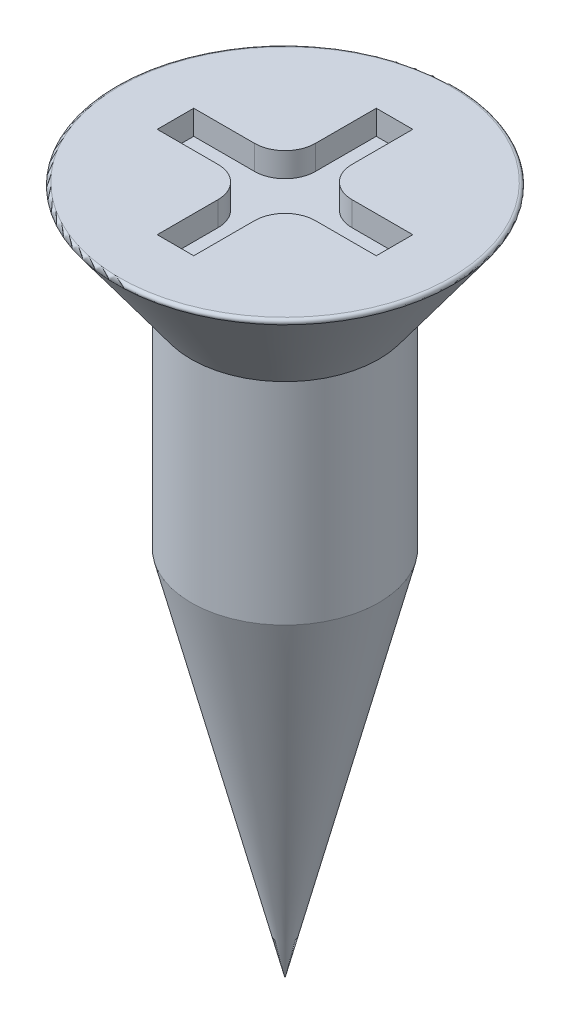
ISO-10303-21;
HEADER;
FILE_DESCRIPTION(('STEP AP214'),'2;1');
FILE_NAME('part.step','',(''),(''),'','','');
FILE_SCHEMA(('AUTOMOTIVE_DESIGN { 1 0 10303 214 1 1 1 1 }'));
ENDSEC;
DATA;
#1=APPLICATION_CONTEXT('core data for automotive mechanical design processes');
#2=APPLICATION_PROTOCOL_DEFINITION('international standard','automotive_design',2000,#1);
#3=PRODUCT_CONTEXT('',#1,'mechanical');
#4=PRODUCT('Part','Part','',(#3));
#5=PRODUCT_RELATED_PRODUCT_CATEGORY('part','',(#4));
#6=PRODUCT_DEFINITION_FORMATION('','',#4);
#7=PRODUCT_DEFINITION_CONTEXT('part definition',#1,'design');
#8=PRODUCT_DEFINITION('design','',#6,#7);
#9=PRODUCT_DEFINITION_SHAPE('','',#8);
#10=(LENGTH_UNIT() NAMED_UNIT(*) SI_UNIT(.MILLI.,.METRE.));
#11=(NAMED_UNIT(*) PLANE_ANGLE_UNIT() SI_UNIT($,.RADIAN.));
#12=(NAMED_UNIT(*) SI_UNIT($,.STERADIAN.) SOLID_ANGLE_UNIT());
#13=UNCERTAINTY_MEASURE_WITH_UNIT(LENGTH_MEASURE(1.E-05),#10,'distance_accuracy_value','');
#14=(GEOMETRIC_REPRESENTATION_CONTEXT(3) GLOBAL_UNCERTAINTY_ASSIGNED_CONTEXT((#13)) GLOBAL_UNIT_ASSIGNED_CONTEXT((#10,
#11,#12)) REPRESENTATION_CONTEXT('',''));
#15=CARTESIAN_POINT('',(0.,0.,0.));
#16=DIRECTION('',(0.,0.,1.));
#17=DIRECTION('',(1.,0.,0.));
#18=AXIS2_PLACEMENT_3D('',#15,#16,#17);
#19=CARTESIAN_POINT('',(0.,10.3838251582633,0.));
#20=DIRECTION('',(0.,1.,0.));
#21=DIRECTION('',(-1.,0.,0.));
#22=AXIS2_PLACEMENT_3D('',#19,#20,#21);
#23=CYLINDRICAL_SURFACE('',#22,1.54304418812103);
#24=CARTESIAN_POINT('',(0.,6.11360636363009,0.));
#25=DIRECTION('',(0.,1.,0.));
#26=DIRECTION('',(-1.,0.,0.));
#27=AXIS2_PLACEMENT_3D('',#24,#25,#26);
#28=CIRCLE('',#27,1.54304418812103);
#29=CARTESIAN_POINT('',(-1.54304418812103,6.11360636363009,0.));
#30=VERTEX_POINT('',#29);
#31=EDGE_CURVE('E223',#30,#30,#28,.T.);
#32=ORIENTED_EDGE('',*,*,#31,.T.);
#33=EDGE_LOOP('',(#32));
#34=FACE_BOUND('',#33,.T.);
#35=CARTESIAN_POINT('',(0.,9.57813960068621,0.));
#36=DIRECTION('',(0.,1.,0.));
#37=DIRECTION('',(-1.,0.,0.));
#38=AXIS2_PLACEMENT_3D('',#35,#36,#37);
#39=CIRCLE('',#38,1.54304418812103);
#40=CARTESIAN_POINT('',(-1.54304418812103,9.57813960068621,0.));
#41=VERTEX_POINT('',#40);
#42=EDGE_CURVE('E240',#41,#41,#39,.T.);
#43=ORIENTED_EDGE('',*,*,#42,.F.);
#44=EDGE_LOOP('',(#43));
#45=FACE_BOUND('',#44,.T.);
#46=ADVANCED_FACE('F32',(#34,#45),#23,.T.);
#47=CARTESIAN_POINT('',(0.,11.3295965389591,0.));
#48=DIRECTION('',(0.,1.,0.));
#49=DIRECTION('',(-1.,0.,0.));
#50=AXIS2_PLACEMENT_3D('',#47,#48,#49);
#51=CONICAL_SURFACE('',#50,2.82171279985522,0.630616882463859);
#52=CARTESIAN_POINT('',(0.,11.2501143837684,0.));
#53=DIRECTION('',(0.,-1.,0.));
#54=DIRECTION('',(1.,0.,0.));
#55=AXIS2_PLACEMENT_3D('',#52,#53,#54);
#56=CIRCLE('',#55,2.76368605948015);
#57=CARTESIAN_POINT('',(2.76368605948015,11.2501143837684,0.));
#58=VERTEX_POINT('',#57);
#59=EDGE_CURVE('E246',#58,#58,#56,.T.);
#60=ORIENTED_EDGE('',*,*,#59,.T.);
#61=EDGE_LOOP('',(#60));
#62=FACE_BOUND('',#61,.T.);
#63=ORIENTED_EDGE('',*,*,#42,.T.);
#64=EDGE_LOOP('',(#63));
#65=FACE_BOUND('',#64,.T.);
#66=ADVANCED_FACE('F314',(#62,#65),#51,.T.);
#67=CARTESIAN_POINT('',(-0.682551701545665,11.3295965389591,0.));
#68=DIRECTION('',(0.,1.,0.));
#69=DIRECTION('',(-1.,0.,0.));
#70=AXIS2_PLACEMENT_3D('',#67,#68,#69);
#71=PLANE('',#70);
#72=CARTESIAN_POINT('',(0.,11.3295965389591,0.));
#73=DIRECTION('',(0.,1.,0.));
#74=DIRECTION('',(-1.,0.,0.));
#75=AXIS2_PLACEMENT_3D('',#72,#73,#74);
#76=CIRCLE('',#75,2.72330286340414);
#77=CARTESIAN_POINT('',(-2.72330286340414,11.3295965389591,0.));
#78=VERTEX_POINT('',#77);
#79=EDGE_CURVE('E243',#78,#78,#76,.T.);
#80=ORIENTED_EDGE('',*,*,#79,.T.);
#81=EDGE_LOOP('',(#80));
#82=FACE_BOUND('',#81,.T.);
#83=DIRECTION('',(1.,0.,0.));
#84=VECTOR('',#83,1.);
#85=CARTESIAN_POINT('',(0.299999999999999,11.3295965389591,0.3));
#86=LINE('',#85,#84);
#87=CARTESIAN_POINT('',(0.8,11.3295965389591,0.3));
#88=VERTEX_POINT('',#87);
#89=CARTESIAN_POINT('',(1.8,11.3295965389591,0.3));
#90=VERTEX_POINT('',#89);
#91=EDGE_CURVE('E214',#88,#90,#86,.T.);
#92=ORIENTED_EDGE('',*,*,#91,.F.);
#93=CARTESIAN_POINT('',(0.8,11.3295965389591,0.8));
#94=DIRECTION('',(0.,1.,0.));
#95=DIRECTION('',(-1.,0.,0.));
#96=AXIS2_PLACEMENT_3D('',#93,#94,#95);
#97=CIRCLE('',#96,0.5);
#98=CARTESIAN_POINT('',(0.299999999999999,11.3295965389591,0.8));
#99=VERTEX_POINT('',#98);
#100=EDGE_CURVE('E258',#88,#99,#97,.T.);
#101=ORIENTED_EDGE('',*,*,#100,.T.);
#102=DIRECTION('',(0.,0.,-1.));
#103=VECTOR('',#102,1.);
#104=CARTESIAN_POINT('',(0.3,11.3295965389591,1.8));
#105=LINE('',#104,#103);
#106=CARTESIAN_POINT('',(0.3,11.3295965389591,1.8));
#107=VERTEX_POINT('',#106);
#108=EDGE_CURVE('E211',#107,#99,#105,.T.);
#109=ORIENTED_EDGE('',*,*,#108,.F.);
#110=DIRECTION('',(1.,0.,0.));
#111=VECTOR('',#110,1.);
#112=CARTESIAN_POINT('',(-0.3,11.3295965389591,1.8));
#113=LINE('',#112,#111);
#114=CARTESIAN_POINT('',(-0.3,11.3295965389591,1.8));
#115=VERTEX_POINT('',#114);
#116=EDGE_CURVE('E208',#115,#107,#113,.T.);
#117=ORIENTED_EDGE('',*,*,#116,.F.);
#118=DIRECTION('',(0.,0.,1.));
#119=VECTOR('',#118,1.);
#120=CARTESIAN_POINT('',(-0.3,11.3295965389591,1.8));
#121=LINE('',#120,#119);
#122=CARTESIAN_POINT('',(-0.3,11.3295965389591,0.8));
#123=VERTEX_POINT('',#122);
#124=EDGE_CURVE('E206',#123,#115,#121,.T.);
#125=ORIENTED_EDGE('',*,*,#124,.F.);
#126=CARTESIAN_POINT('',(-0.8,11.3295965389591,0.8));
#127=DIRECTION('',(0.,1.,0.));
#128=DIRECTION('',(-1.,0.,0.));
#129=AXIS2_PLACEMENT_3D('',#126,#127,#128);
#130=CIRCLE('',#129,0.5);
#131=CARTESIAN_POINT('',(-0.8,11.3295965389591,0.3));
#132=VERTEX_POINT('',#131);
#133=EDGE_CURVE('E254',#123,#132,#130,.T.);
#134=ORIENTED_EDGE('',*,*,#133,.T.);
#135=DIRECTION('',(1.,0.,0.));
#136=VECTOR('',#135,1.);
#137=CARTESIAN_POINT('',(-0.3,11.3295965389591,0.3));
#138=LINE('',#137,#136);
#139=CARTESIAN_POINT('',(-1.8,11.3295965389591,0.3));
#140=VERTEX_POINT('',#139);
#141=EDGE_CURVE('E203',#140,#132,#138,.T.);
#142=ORIENTED_EDGE('',*,*,#141,.F.);
#143=DIRECTION('',(0.,0.,1.));
#144=VECTOR('',#143,1.);
#145=CARTESIAN_POINT('',(-1.8,11.3295965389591,-0.3));
#146=LINE('',#145,#144);
#147=CARTESIAN_POINT('',(-1.8,11.3295965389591,-0.3));
#148=VERTEX_POINT('',#147);
#149=EDGE_CURVE('E200',#148,#140,#146,.T.);
#150=ORIENTED_EDGE('',*,*,#149,.F.);
#151=DIRECTION('',(-1.,0.,0.));
#152=VECTOR('',#151,1.);
#153=CARTESIAN_POINT('',(-0.3,11.3295965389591,-0.3));
#154=LINE('',#153,#152);
#155=CARTESIAN_POINT('',(-0.8,11.3295965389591,-0.3));
#156=VERTEX_POINT('',#155);
#157=EDGE_CURVE('E198',#156,#148,#154,.T.);
#158=ORIENTED_EDGE('',*,*,#157,.F.);
#159=CARTESIAN_POINT('',(-0.8,11.3295965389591,-0.8));
#160=DIRECTION('',(0.,1.,0.));
#161=DIRECTION('',(-1.,0.,0.));
#162=AXIS2_PLACEMENT_3D('',#159,#160,#161);
#163=CIRCLE('',#162,0.5);
#164=CARTESIAN_POINT('',(-0.3,11.3295965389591,-0.8));
#165=VERTEX_POINT('',#164);
#166=EDGE_CURVE('E252',#156,#165,#163,.T.);
#167=ORIENTED_EDGE('',*,*,#166,.T.);
#168=DIRECTION('',(0.,0.,1.));
#169=VECTOR('',#168,1.);
#170=CARTESIAN_POINT('',(-0.3,11.3295965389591,-1.8));
#171=LINE('',#170,#169);
#172=CARTESIAN_POINT('',(-0.3,11.3295965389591,-1.8));
#173=VERTEX_POINT('',#172);
#174=EDGE_CURVE('E196',#173,#165,#171,.T.);
#175=ORIENTED_EDGE('',*,*,#174,.F.);
#176=DIRECTION('',(-1.,0.,0.));
#177=VECTOR('',#176,1.);
#178=CARTESIAN_POINT('',(-0.3,11.3295965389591,-1.8));
#179=LINE('',#178,#177);
#180=CARTESIAN_POINT('',(0.3,11.3295965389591,-1.8));
#181=VERTEX_POINT('',#180);
#182=EDGE_CURVE('E154',#181,#173,#179,.T.);
#183=ORIENTED_EDGE('',*,*,#182,.F.);
#184=DIRECTION('',(0.,0.,-1.));
#185=VECTOR('',#184,1.);
#186=CARTESIAN_POINT('',(0.3,11.3295965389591,-1.8));
#187=LINE('',#186,#185);
#188=CARTESIAN_POINT('',(0.299999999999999,11.3295965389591,-0.8));
#189=VERTEX_POINT('',#188);
#190=EDGE_CURVE('E166',#189,#181,#187,.T.);
#191=ORIENTED_EDGE('',*,*,#190,.F.);
#192=CARTESIAN_POINT('',(0.8,11.3295965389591,-0.8));
#193=DIRECTION('',(0.,1.,0.));
#194=DIRECTION('',(-1.,0.,0.));
#195=AXIS2_PLACEMENT_3D('',#192,#193,#194);
#196=CIRCLE('',#195,0.5);
#197=CARTESIAN_POINT('',(0.8,11.3295965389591,-0.3));
#198=VERTEX_POINT('',#197);
#199=EDGE_CURVE('E256',#189,#198,#196,.T.);
#200=ORIENTED_EDGE('',*,*,#199,.T.);
#201=DIRECTION('',(-1.,0.,0.));
#202=VECTOR('',#201,1.);
#203=CARTESIAN_POINT('',(0.299999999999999,11.3295965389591,-0.3));
#204=LINE('',#203,#202);
#205=CARTESIAN_POINT('',(1.8,11.3295965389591,-0.3));
#206=VERTEX_POINT('',#205);
#207=EDGE_CURVE('E168',#206,#198,#204,.T.);
#208=ORIENTED_EDGE('',*,*,#207,.F.);
#209=DIRECTION('',(0.,0.,-1.));
#210=VECTOR('',#209,1.);
#211=CARTESIAN_POINT('',(1.8,11.3295965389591,0.3));
#212=LINE('',#211,#210);
#213=EDGE_CURVE('E216',#90,#206,#212,.T.);
#214=ORIENTED_EDGE('',*,*,#213,.F.);
#215=EDGE_LOOP('',(#92,#101,#109,#117,#125,#134,#142,#150,#158,#167,#175,#183,#191,#200,#208,#214));
#216=FACE_BOUND('',#215,.T.);
#217=ADVANCED_FACE('F294',(#82,#216),#71,.T.);
#218=CARTESIAN_POINT('',(0.,6.11360636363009,0.));
#219=DIRECTION('',(0.,1.,0.));
#220=DIRECTION('',(-1.,0.,0.));
#221=AXIS2_PLACEMENT_3D('',#218,#219,#220);
#222=CONICAL_SURFACE('',#221,1.54304418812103,0.247231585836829);
#223=CARTESIAN_POINT('',(0.,0.,0.));
#224=VERTEX_POINT('',#223);
#225=VERTEX_LOOP('',#224);
#226=FACE_BOUND('',#225,.T.);
#227=ORIENTED_EDGE('',*,*,#31,.F.);
#228=EDGE_LOOP('',(#227));
#229=FACE_BOUND('',#228,.T.);
#230=ADVANCED_FACE('F384',(#226,#229),#222,.T.);
#231=CARTESIAN_POINT('',(-0.3,10.9295965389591,-1.8));
#232=DIRECTION('',(0.,0.,-1.));
#233=DIRECTION('',(-1.,0.,0.));
#234=AXIS2_PLACEMENT_3D('',#231,#232,#233);
#235=PLANE('',#234);
#236=ORIENTED_EDGE('',*,*,#182,.T.);
#237=DIRECTION('',(0.,1.,0.));
#238=VECTOR('',#237,1.);
#239=CARTESIAN_POINT('',(-0.3,10.9295965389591,-1.8));
#240=LINE('',#239,#238);
#241=CARTESIAN_POINT('',(-0.3,10.9295965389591,-1.8));
#242=VERTEX_POINT('',#241);
#243=EDGE_CURVE('E148',#242,#173,#240,.T.);
#244=ORIENTED_EDGE('',*,*,#243,.F.);
#245=DIRECTION('',(-1.,0.,0.));
#246=VECTOR('',#245,1.);
#247=CARTESIAN_POINT('',(-0.3,10.9295965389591,-1.8));
#248=LINE('',#247,#246);
#249=CARTESIAN_POINT('',(0.3,10.9295965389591,-1.8));
#250=VERTEX_POINT('',#249);
#251=EDGE_CURVE('E152',#250,#242,#248,.T.);
#252=ORIENTED_EDGE('',*,*,#251,.F.);
#253=DIRECTION('',(0.,1.,0.));
#254=VECTOR('',#253,1.);
#255=CARTESIAN_POINT('',(0.3,10.9295965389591,-1.8));
#256=LINE('',#255,#254);
#257=EDGE_CURVE('E221',#250,#181,#256,.T.);
#258=ORIENTED_EDGE('',*,*,#257,.T.);
#259=EDGE_LOOP('',(#236,#244,#252,#258));
#260=FACE_BOUND('',#259,.T.);
#261=ADVANCED_FACE('F149',(#260),#235,.F.);
#262=CARTESIAN_POINT('',(0.3,10.9295965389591,-1.8));
#263=DIRECTION('',(1.,0.,0.));
#264=DIRECTION('',(0.,0.,-1.));
#265=AXIS2_PLACEMENT_3D('',#262,#263,#264);
#266=PLANE('',#265);
#267=DIRECTION('',(0.,0.,-1.));
#268=VECTOR('',#267,1.);
#269=CARTESIAN_POINT('',(0.3,10.9295965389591,-1.8));
#270=LINE('',#269,#268);
#271=CARTESIAN_POINT('',(0.299999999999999,10.9295965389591,-0.8));
#272=VERTEX_POINT('',#271);
#273=EDGE_CURVE('E157',#272,#250,#270,.T.);
#274=ORIENTED_EDGE('',*,*,#273,.F.);
#275=DIRECTION('',(0.,1.,0.));
#276=VECTOR('',#275,1.);
#277=CARTESIAN_POINT('',(0.299999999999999,10.9295965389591,-0.8));
#278=LINE('',#277,#276);
#279=EDGE_CURVE('E262',#272,#189,#278,.T.);
#280=ORIENTED_EDGE('',*,*,#279,.T.);
#281=ORIENTED_EDGE('',*,*,#190,.T.);
#282=ORIENTED_EDGE('',*,*,#257,.F.);
#283=EDGE_LOOP('',(#274,#280,#281,#282));
#284=FACE_BOUND('',#283,.T.);
#285=ADVANCED_FACE('F342',(#284),#266,.F.);
#286=CARTESIAN_POINT('',(0.299999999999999,10.9295965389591,-0.3));
#287=DIRECTION('',(0.,0.,-1.));
#288=DIRECTION('',(-1.,0.,0.));
#289=AXIS2_PLACEMENT_3D('',#286,#287,#288);
#290=PLANE('',#289);
#291=ORIENTED_EDGE('',*,*,#207,.T.);
#292=DIRECTION('',(0.,1.,0.));
#293=VECTOR('',#292,1.);
#294=CARTESIAN_POINT('',(0.8,10.9295965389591,-0.3));
#295=LINE('',#294,#293);
#296=CARTESIAN_POINT('',(0.8,10.9295965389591,-0.3));
#297=VERTEX_POINT('',#296);
#298=EDGE_CURVE('E265',#198,#297,#295,.F.);
#299=ORIENTED_EDGE('',*,*,#298,.T.);
#300=DIRECTION('',(-1.,0.,0.));
#301=VECTOR('',#300,1.);
#302=CARTESIAN_POINT('',(0.299999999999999,10.9295965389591,-0.3));
#303=LINE('',#302,#301);
#304=CARTESIAN_POINT('',(1.8,10.9295965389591,-0.3));
#305=VERTEX_POINT('',#304);
#306=EDGE_CURVE('E191',#305,#297,#303,.T.);
#307=ORIENTED_EDGE('',*,*,#306,.F.);
#308=DIRECTION('',(0.,1.,0.));
#309=VECTOR('',#308,1.);
#310=CARTESIAN_POINT('',(1.8,10.9295965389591,-0.3));
#311=LINE('',#310,#309);
#312=EDGE_CURVE('E224',#305,#206,#311,.T.);
#313=ORIENTED_EDGE('',*,*,#312,.T.);
#314=EDGE_LOOP('',(#291,#299,#307,#313));
#315=FACE_BOUND('',#314,.T.);
#316=ADVANCED_FACE('F347',(#315),#290,.F.);
#317=CARTESIAN_POINT('',(1.8,10.9295965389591,0.3));
#318=DIRECTION('',(1.,0.,0.));
#319=DIRECTION('',(0.,1.,0.));
#320=AXIS2_PLACEMENT_3D('',#317,#318,#319);
#321=PLANE('',#320);
#322=ORIENTED_EDGE('',*,*,#213,.T.);
#323=ORIENTED_EDGE('',*,*,#312,.F.);
#324=DIRECTION('',(0.,0.,-1.));
#325=VECTOR('',#324,1.);
#326=CARTESIAN_POINT('',(1.8,10.9295965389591,0.3));
#327=LINE('',#326,#325);
#328=CARTESIAN_POINT('',(1.8,10.9295965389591,0.3));
#329=VERTEX_POINT('',#328);
#330=EDGE_CURVE('E188',#329,#305,#327,.T.);
#331=ORIENTED_EDGE('',*,*,#330,.F.);
#332=DIRECTION('',(0.,1.,0.));
#333=VECTOR('',#332,1.);
#334=CARTESIAN_POINT('',(1.8,10.9295965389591,0.3));
#335=LINE('',#334,#333);
#336=EDGE_CURVE('E226',#329,#90,#335,.T.);
#337=ORIENTED_EDGE('',*,*,#336,.T.);
#338=EDGE_LOOP('',(#322,#323,#331,#337));
#339=FACE_BOUND('',#338,.T.);
#340=ADVANCED_FACE('F350',(#339),#321,.F.);
#341=CARTESIAN_POINT('',(0.299999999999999,10.9295965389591,0.3));
#342=DIRECTION('',(0.,0.,1.));
#343=DIRECTION('',(1.,0.,0.));
#344=AXIS2_PLACEMENT_3D('',#341,#342,#343);
#345=PLANE('',#344);
#346=DIRECTION('',(1.,0.,0.));
#347=VECTOR('',#346,1.);
#348=CARTESIAN_POINT('',(0.299999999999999,10.9295965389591,0.3));
#349=LINE('',#348,#347);
#350=CARTESIAN_POINT('',(0.8,10.9295965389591,0.3));
#351=VERTEX_POINT('',#350);
#352=EDGE_CURVE('E186',#351,#329,#349,.T.);
#353=ORIENTED_EDGE('',*,*,#352,.F.);
#354=DIRECTION('',(0.,1.,0.));
#355=VECTOR('',#354,1.);
#356=CARTESIAN_POINT('',(0.8,10.9295965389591,0.3));
#357=LINE('',#356,#355);
#358=EDGE_CURVE('E249',#351,#88,#357,.T.);
#359=ORIENTED_EDGE('',*,*,#358,.T.);
#360=ORIENTED_EDGE('',*,*,#91,.T.);
#361=ORIENTED_EDGE('',*,*,#336,.F.);
#362=EDGE_LOOP('',(#353,#359,#360,#361));
#363=FACE_BOUND('',#362,.T.);
#364=ADVANCED_FACE('F355',(#363),#345,.F.);
#365=CARTESIAN_POINT('',(0.3,10.9295965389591,1.8));
#366=DIRECTION('',(1.,0.,0.));
#367=DIRECTION('',(0.,0.,-1.));
#368=AXIS2_PLACEMENT_3D('',#365,#366,#367);
#369=PLANE('',#368);
#370=ORIENTED_EDGE('',*,*,#108,.T.);
#371=DIRECTION('',(0.,1.,0.));
#372=VECTOR('',#371,1.);
#373=CARTESIAN_POINT('',(0.299999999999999,10.9295965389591,0.8));
#374=LINE('',#373,#372);
#375=CARTESIAN_POINT('',(0.299999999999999,10.9295965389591,0.8));
#376=VERTEX_POINT('',#375);
#377=EDGE_CURVE('E260',#99,#376,#374,.F.);
#378=ORIENTED_EDGE('',*,*,#377,.T.);
#379=DIRECTION('',(0.,0.,-1.));
#380=VECTOR('',#379,1.);
#381=CARTESIAN_POINT('',(0.3,10.9295965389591,1.8));
#382=LINE('',#381,#380);
#383=CARTESIAN_POINT('',(0.3,10.9295965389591,1.8));
#384=VERTEX_POINT('',#383);
#385=EDGE_CURVE('E183',#384,#376,#382,.T.);
#386=ORIENTED_EDGE('',*,*,#385,.F.);
#387=DIRECTION('',(0.,1.,0.));
#388=VECTOR('',#387,1.);
#389=CARTESIAN_POINT('',(0.3,10.9295965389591,1.8));
#390=LINE('',#389,#388);
#391=EDGE_CURVE('E229',#384,#107,#390,.T.);
#392=ORIENTED_EDGE('',*,*,#391,.T.);
#393=EDGE_LOOP('',(#370,#378,#386,#392));
#394=FACE_BOUND('',#393,.T.);
#395=ADVANCED_FACE('F361',(#394),#369,.F.);
#396=CARTESIAN_POINT('',(-0.3,10.9295965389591,1.8));
#397=DIRECTION('',(0.,0.,1.));
#398=DIRECTION('',(1.,0.,0.));
#399=AXIS2_PLACEMENT_3D('',#396,#397,#398);
#400=PLANE('',#399);
#401=ORIENTED_EDGE('',*,*,#116,.T.);
#402=ORIENTED_EDGE('',*,*,#391,.F.);
#403=DIRECTION('',(1.,0.,0.));
#404=VECTOR('',#403,1.);
#405=CARTESIAN_POINT('',(-0.3,10.9295965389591,1.8));
#406=LINE('',#405,#404);
#407=CARTESIAN_POINT('',(-0.3,10.9295965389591,1.8));
#408=VERTEX_POINT('',#407);
#409=EDGE_CURVE('E180',#408,#384,#406,.T.);
#410=ORIENTED_EDGE('',*,*,#409,.F.);
#411=DIRECTION('',(0.,1.,0.));
#412=VECTOR('',#411,1.);
#413=CARTESIAN_POINT('',(-0.3,10.9295965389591,1.8));
#414=LINE('',#413,#412);
#415=EDGE_CURVE('E231',#408,#115,#414,.T.);
#416=ORIENTED_EDGE('',*,*,#415,.T.);
#417=EDGE_LOOP('',(#401,#402,#410,#416));
#418=FACE_BOUND('',#417,.T.);
#419=ADVANCED_FACE('F363',(#418),#400,.F.);
#420=CARTESIAN_POINT('',(-0.3,10.9295965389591,1.8));
#421=DIRECTION('',(-1.,0.,0.));
#422=DIRECTION('',(0.,0.,1.));
#423=AXIS2_PLACEMENT_3D('',#420,#421,#422);
#424=PLANE('',#423);
#425=DIRECTION('',(0.,0.,1.));
#426=VECTOR('',#425,1.);
#427=CARTESIAN_POINT('',(-0.3,10.9295965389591,1.8));
#428=LINE('',#427,#426);
#429=CARTESIAN_POINT('',(-0.3,10.9295965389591,0.8));
#430=VERTEX_POINT('',#429);
#431=EDGE_CURVE('E178',#430,#408,#428,.T.);
#432=ORIENTED_EDGE('',*,*,#431,.F.);
#433=DIRECTION('',(0.,1.,0.));
#434=VECTOR('',#433,1.);
#435=CARTESIAN_POINT('',(-0.3,10.9295965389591,0.8));
#436=LINE('',#435,#434);
#437=EDGE_CURVE('E267',#430,#123,#436,.T.);
#438=ORIENTED_EDGE('',*,*,#437,.T.);
#439=ORIENTED_EDGE('',*,*,#124,.T.);
#440=ORIENTED_EDGE('',*,*,#415,.F.);
#441=EDGE_LOOP('',(#432,#438,#439,#440));
#442=FACE_BOUND('',#441,.T.);
#443=ADVANCED_FACE('F287',(#442),#424,.F.);
#444=CARTESIAN_POINT('',(-0.3,10.9295965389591,0.3));
#445=DIRECTION('',(0.,0.,1.));
#446=DIRECTION('',(1.,0.,0.));
#447=AXIS2_PLACEMENT_3D('',#444,#445,#446);
#448=PLANE('',#447);
#449=ORIENTED_EDGE('',*,*,#141,.T.);
#450=DIRECTION('',(0.,1.,0.));
#451=VECTOR('',#450,1.);
#452=CARTESIAN_POINT('',(-0.8,10.9295965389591,0.3));
#453=LINE('',#452,#451);
#454=CARTESIAN_POINT('',(-0.8,10.9295965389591,0.3));
#455=VERTEX_POINT('',#454);
#456=EDGE_CURVE('E270',#132,#455,#453,.F.);
#457=ORIENTED_EDGE('',*,*,#456,.T.);
#458=DIRECTION('',(1.,0.,0.));
#459=VECTOR('',#458,1.);
#460=CARTESIAN_POINT('',(-0.3,10.9295965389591,0.3));
#461=LINE('',#460,#459);
#462=CARTESIAN_POINT('',(-1.8,10.9295965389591,0.3));
#463=VERTEX_POINT('',#462);
#464=EDGE_CURVE('E175',#463,#455,#461,.T.);
#465=ORIENTED_EDGE('',*,*,#464,.F.);
#466=DIRECTION('',(0.,1.,0.));
#467=VECTOR('',#466,1.);
#468=CARTESIAN_POINT('',(-1.8,10.9295965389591,0.3));
#469=LINE('',#468,#467);
#470=EDGE_CURVE('E234',#463,#140,#469,.T.);
#471=ORIENTED_EDGE('',*,*,#470,.T.);
#472=EDGE_LOOP('',(#449,#457,#465,#471));
#473=FACE_BOUND('',#472,.T.);
#474=ADVANCED_FACE('F298',(#473),#448,.F.);
#475=CARTESIAN_POINT('',(-1.8,10.9295965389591,-0.3));
#476=DIRECTION('',(-1.,0.,0.));
#477=DIRECTION('',(0.,-1.,0.));
#478=AXIS2_PLACEMENT_3D('',#475,#476,#477);
#479=PLANE('',#478);
#480=ORIENTED_EDGE('',*,*,#149,.T.);
#481=ORIENTED_EDGE('',*,*,#470,.F.);
#482=DIRECTION('',(0.,0.,1.));
#483=VECTOR('',#482,1.);
#484=CARTESIAN_POINT('',(-1.8,10.9295965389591,-0.3));
#485=LINE('',#484,#483);
#486=CARTESIAN_POINT('',(-1.8,10.9295965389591,-0.3));
#487=VERTEX_POINT('',#486);
#488=EDGE_CURVE('E172',#487,#463,#485,.T.);
#489=ORIENTED_EDGE('',*,*,#488,.F.);
#490=DIRECTION('',(0.,1.,0.));
#491=VECTOR('',#490,1.);
#492=CARTESIAN_POINT('',(-1.8,10.9295965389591,-0.3));
#493=LINE('',#492,#491);
#494=EDGE_CURVE('E156',#487,#148,#493,.T.);
#495=ORIENTED_EDGE('',*,*,#494,.T.);
#496=EDGE_LOOP('',(#480,#481,#489,#495));
#497=FACE_BOUND('',#496,.T.);
#498=ADVANCED_FACE('F301',(#497),#479,.F.);
#499=CARTESIAN_POINT('',(-0.3,10.9295965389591,-0.3));
#500=DIRECTION('',(0.,0.,-1.));
#501=DIRECTION('',(-1.,0.,0.));
#502=AXIS2_PLACEMENT_3D('',#499,#500,#501);
#503=PLANE('',#502);
#504=DIRECTION('',(-1.,0.,0.));
#505=VECTOR('',#504,1.);
#506=CARTESIAN_POINT('',(-0.3,10.9295965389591,-0.3));
#507=LINE('',#506,#505);
#508=CARTESIAN_POINT('',(-0.8,10.9295965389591,-0.3));
#509=VERTEX_POINT('',#508);
#510=EDGE_CURVE('E161',#509,#487,#507,.T.);
#511=ORIENTED_EDGE('',*,*,#510,.F.);
#512=DIRECTION('',(0.,1.,0.));
#513=VECTOR('',#512,1.);
#514=CARTESIAN_POINT('',(-0.8,10.9295965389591,-0.3));
#515=LINE('',#514,#513);
#516=EDGE_CURVE('E272',#509,#156,#515,.T.);
#517=ORIENTED_EDGE('',*,*,#516,.T.);
#518=ORIENTED_EDGE('',*,*,#157,.T.);
#519=ORIENTED_EDGE('',*,*,#494,.F.);
#520=EDGE_LOOP('',(#511,#517,#518,#519));
#521=FACE_BOUND('',#520,.T.);
#522=ADVANCED_FACE('F305',(#521),#503,.F.);
#523=CARTESIAN_POINT('',(-0.3,10.9295965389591,-1.8));
#524=DIRECTION('',(-1.,0.,0.));
#525=DIRECTION('',(0.,0.,1.));
#526=AXIS2_PLACEMENT_3D('',#523,#524,#525);
#527=PLANE('',#526);
#528=ORIENTED_EDGE('',*,*,#174,.T.);
#529=DIRECTION('',(0.,1.,0.));
#530=VECTOR('',#529,1.);
#531=CARTESIAN_POINT('',(-0.3,10.9295965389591,-0.8));
#532=LINE('',#531,#530);
#533=CARTESIAN_POINT('',(-0.3,10.9295965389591,-0.8));
#534=VERTEX_POINT('',#533);
#535=EDGE_CURVE('E47',#165,#534,#532,.F.);
#536=ORIENTED_EDGE('',*,*,#535,.T.);
#537=DIRECTION('',(0.,0.,1.));
#538=VECTOR('',#537,1.);
#539=CARTESIAN_POINT('',(-0.3,10.9295965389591,-1.8));
#540=LINE('',#539,#538);
#541=EDGE_CURVE('E159',#242,#534,#540,.T.);
#542=ORIENTED_EDGE('',*,*,#541,.F.);
#543=ORIENTED_EDGE('',*,*,#243,.T.);
#544=EDGE_LOOP('',(#528,#536,#542,#543));
#545=FACE_BOUND('',#544,.T.);
#546=ADVANCED_FACE('F160',(#545),#527,.F.);
#547=CARTESIAN_POINT('',(0.,10.9295965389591,0.));
#548=DIRECTION('',(0.,-1.,0.));
#549=DIRECTION('',(0.,0.,-1.));
#550=AXIS2_PLACEMENT_3D('',#547,#548,#549);
#551=PLANE('',#550);
#552=ORIENTED_EDGE('',*,*,#251,.T.);
#553=ORIENTED_EDGE('',*,*,#541,.T.);
#554=CARTESIAN_POINT('',(-0.8,10.9295965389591,-0.8));
#555=DIRECTION('',(0.,-1.,0.));
#556=DIRECTION('',(0.,0.,-1.));
#557=AXIS2_PLACEMENT_3D('',#554,#555,#556);
#558=CIRCLE('',#557,0.5);
#559=EDGE_CURVE('E11',#534,#509,#558,.T.);
#560=ORIENTED_EDGE('',*,*,#559,.T.);
#561=ORIENTED_EDGE('',*,*,#510,.T.);
#562=ORIENTED_EDGE('',*,*,#488,.T.);
#563=ORIENTED_EDGE('',*,*,#464,.T.);
#564=CARTESIAN_POINT('',(-0.8,10.9295965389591,0.8));
#565=DIRECTION('',(0.,-1.,0.));
#566=DIRECTION('',(0.,0.,-1.));
#567=AXIS2_PLACEMENT_3D('',#564,#565,#566);
#568=CIRCLE('',#567,0.5);
#569=EDGE_CURVE('E40',#455,#430,#568,.T.);
#570=ORIENTED_EDGE('',*,*,#569,.T.);
#571=ORIENTED_EDGE('',*,*,#431,.T.);
#572=ORIENTED_EDGE('',*,*,#409,.T.);
#573=ORIENTED_EDGE('',*,*,#385,.T.);
#574=CARTESIAN_POINT('',(0.8,10.9295965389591,0.8));
#575=DIRECTION('',(0.,-1.,0.));
#576=DIRECTION('',(0.,0.,-1.));
#577=AXIS2_PLACEMENT_3D('',#574,#575,#576);
#578=CIRCLE('',#577,0.5);
#579=EDGE_CURVE('E276',#376,#351,#578,.T.);
#580=ORIENTED_EDGE('',*,*,#579,.T.);
#581=ORIENTED_EDGE('',*,*,#352,.T.);
#582=ORIENTED_EDGE('',*,*,#330,.T.);
#583=ORIENTED_EDGE('',*,*,#306,.T.);
#584=CARTESIAN_POINT('',(0.8,10.9295965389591,-0.8));
#585=DIRECTION('',(0.,-1.,0.));
#586=DIRECTION('',(0.,0.,-1.));
#587=AXIS2_PLACEMENT_3D('',#584,#585,#586);
#588=CIRCLE('',#587,0.5);
#589=EDGE_CURVE('E278',#297,#272,#588,.T.);
#590=ORIENTED_EDGE('',*,*,#589,.T.);
#591=ORIENTED_EDGE('',*,*,#273,.T.);
#592=EDGE_LOOP('',(#552,#553,#560,#561,#562,#563,#570,#571,#572,#573,#580,#581,#582,#583,#590,#591));
#593=FACE_BOUND('',#592,.T.);
#594=ADVANCED_FACE('F163',(#593),#551,.F.);
#595=CARTESIAN_POINT('',(0.,11.2795965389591,0.));
#596=DIRECTION('',(0.,1.,0.));
#597=DIRECTION('',(-1.,0.,0.));
#598=AXIS2_PLACEMENT_3D('',#595,#596,#597);
#599=TOROIDAL_SURFACE('',#598,2.72330286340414,0.05);
#600=ORIENTED_EDGE('',*,*,#59,.F.);
#601=EDGE_LOOP('',(#600));
#602=FACE_BOUND('',#601,.T.);
#603=ORIENTED_EDGE('',*,*,#79,.F.);
#604=EDGE_LOOP('',(#603));
#605=FACE_BOUND('',#604,.T.);
#606=ADVANCED_FACE('F325',(#602,#605),#599,.T.);
#607=CARTESIAN_POINT('',(0.8,10.9295965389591,0.8));
#608=DIRECTION('',(0.,1.,0.));
#609=DIRECTION('',(-1.,0.,0.));
#610=AXIS2_PLACEMENT_3D('',#607,#608,#609);
#611=CYLINDRICAL_SURFACE('',#610,0.5);
#612=ORIENTED_EDGE('',*,*,#579,.F.);
#613=ORIENTED_EDGE('',*,*,#377,.F.);
#614=ORIENTED_EDGE('',*,*,#100,.F.);
#615=ORIENTED_EDGE('',*,*,#358,.F.);
#616=EDGE_LOOP('',(#612,#613,#614,#615));
#617=FACE_BOUND('',#616,.T.);
#618=ADVANCED_FACE('F328',(#617),#611,.T.);
#619=CARTESIAN_POINT('',(0.8,10.9295965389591,-0.8));
#620=DIRECTION('',(0.,1.,0.));
#621=DIRECTION('',(-1.,0.,0.));
#622=AXIS2_PLACEMENT_3D('',#619,#620,#621);
#623=CYLINDRICAL_SURFACE('',#622,0.5);
#624=ORIENTED_EDGE('',*,*,#589,.F.);
#625=ORIENTED_EDGE('',*,*,#298,.F.);
#626=ORIENTED_EDGE('',*,*,#199,.F.);
#627=ORIENTED_EDGE('',*,*,#279,.F.);
#628=EDGE_LOOP('',(#624,#625,#626,#627));
#629=FACE_BOUND('',#628,.T.);
#630=ADVANCED_FACE('F312',(#629),#623,.T.);
#631=CARTESIAN_POINT('',(-0.8,10.9295965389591,0.8));
#632=DIRECTION('',(0.,1.,0.));
#633=DIRECTION('',(-1.,0.,0.));
#634=AXIS2_PLACEMENT_3D('',#631,#632,#633);
#635=CYLINDRICAL_SURFACE('',#634,0.5);
#636=ORIENTED_EDGE('',*,*,#569,.F.);
#637=ORIENTED_EDGE('',*,*,#456,.F.);
#638=ORIENTED_EDGE('',*,*,#133,.F.);
#639=ORIENTED_EDGE('',*,*,#437,.F.);
#640=EDGE_LOOP('',(#636,#637,#638,#639));
#641=FACE_BOUND('',#640,.T.);
#642=ADVANCED_FACE('F290',(#641),#635,.T.);
#643=CARTESIAN_POINT('',(-0.8,10.9295965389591,-0.8));
#644=DIRECTION('',(0.,1.,0.));
#645=DIRECTION('',(-1.,0.,0.));
#646=AXIS2_PLACEMENT_3D('',#643,#644,#645);
#647=CYLINDRICAL_SURFACE('',#646,0.5);
#648=ORIENTED_EDGE('',*,*,#559,.F.);
#649=ORIENTED_EDGE('',*,*,#535,.F.);
#650=ORIENTED_EDGE('',*,*,#166,.F.);
#651=ORIENTED_EDGE('',*,*,#516,.F.);
#652=EDGE_LOOP('',(#648,#649,#650,#651));
#653=FACE_BOUND('',#652,.T.);
#654=ADVANCED_FACE('F34',(#653),#647,.T.);
#655=CLOSED_SHELL('',(#46,#66,#217,#230,#261,#285,#316,#340,#364,#395,#419,#443,#474,#498,#522,
#546,#594,#606,#618,#630,#642,#654));
#656=MANIFOLD_SOLID_BREP('B2',#655);
#657=ADVANCED_BREP_SHAPE_REPRESENTATION('',(#18,#656),#14);
#658=SHAPE_DEFINITION_REPRESENTATION(#9,#657);
ENDSEC;
END-ISO-10303-21;
